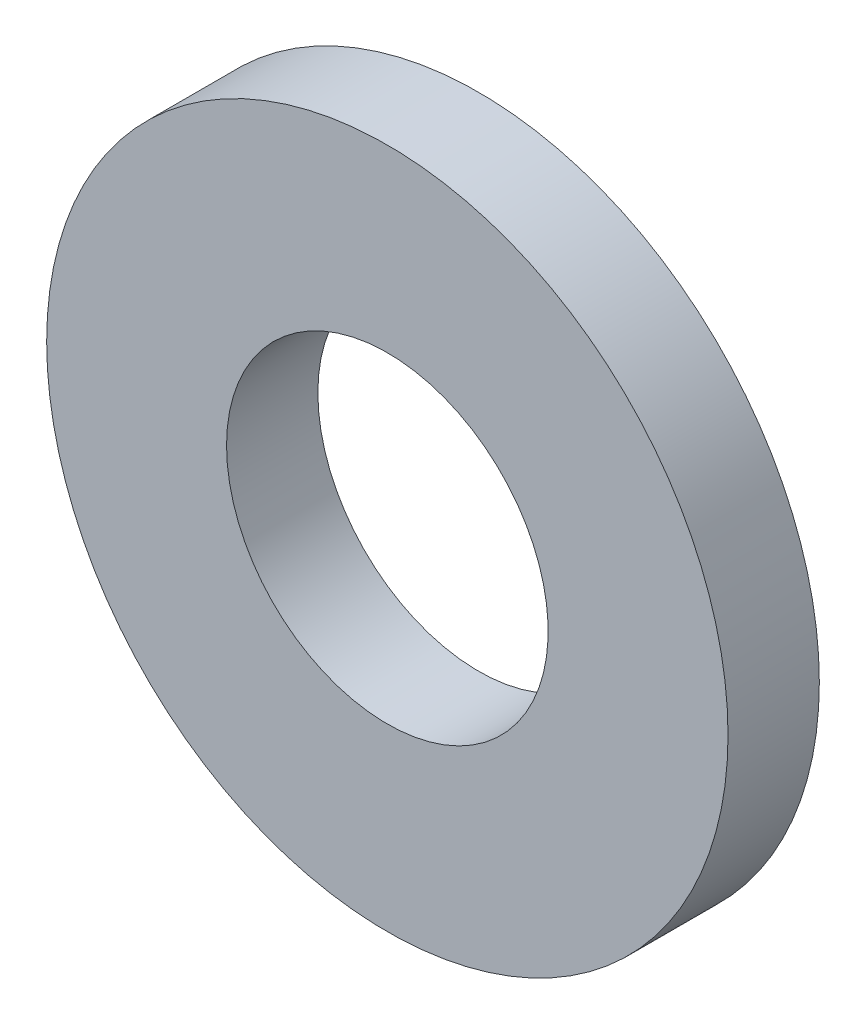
from build123d import *

# Parameters (mm, degrees)
SKETCH1_R                  = 3.175004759
EXTRUDE1_DEPTH             = 0.8509
F_31_0_12_DIAMETER_HOLE1_D = 2.9972


with BuildPart() as part:
    # Sketch1 → Extrude1 (new body)
    with BuildSketch(Plane(origin=(0, 0, 0), x_dir=(-1, 0, 0), z_dir=(0, 0, -1))):
        Circle(SKETCH1_R)
    extrude(amount=EXTRUDE1_DEPTH)

    # 31 _0.12_ Diameter Hole1 (through all)
    with Locations(Plane(origin=(0, 0, -0.8509), x_dir=(-1, 0, 0), z_dir=(0, 0, -1))):
        with Locations((0, 0)):
            Hole(F_31_0_12_DIAMETER_HOLE1_D / 2)


solid = part.part
